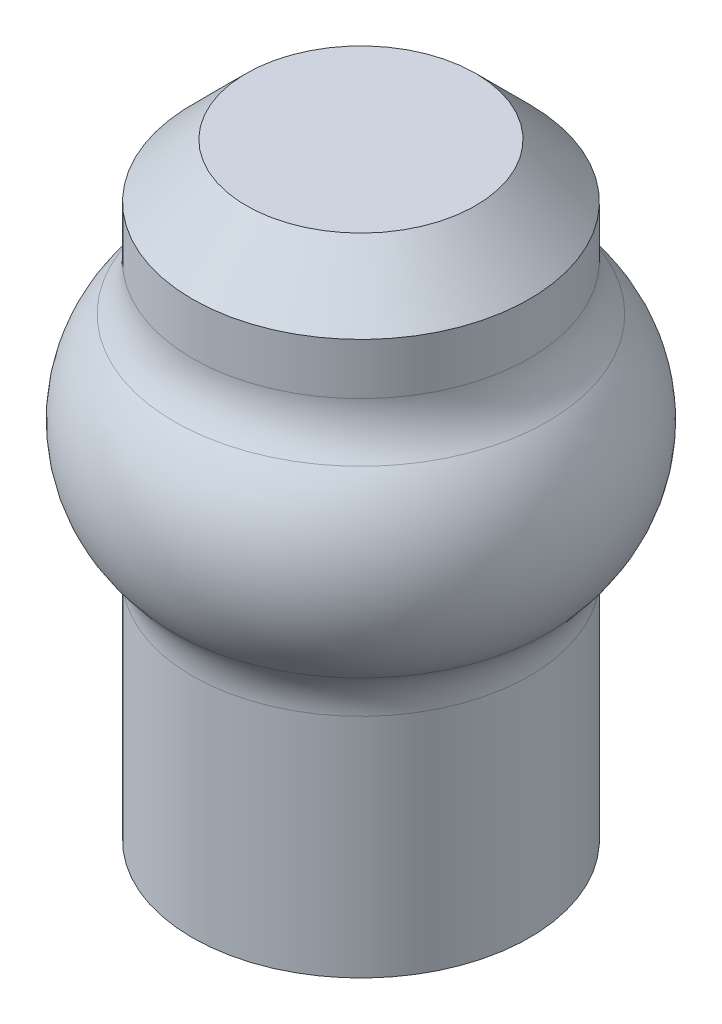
from build123d import *

# Parameters (mm, degrees)
CHAMFER1_SIZE = 4


with BuildPart() as part:
    # Sketch1 → Hub (revolve)
    with BuildSketch(Plane.XY, mode=Mode.PRIVATE) as hub_sk:
        with BuildLine():
            Line((-12.5, 37.198039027), (-12.5, 45))
            Line((-12.5, 45), (0, 45))
            Line((0, 45), (0, 0))
            Line((0, 0), (-12.5, 0))
            Line((-12.5, 0), (-12.5, 16.801960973))
            ThreePointArc((-12.5, 16.801960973), (-12.845253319, 18.627702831), (-13.833333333, 20.201307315))
            ThreePointArc((-13.833333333, 20.201307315), (-16.5, 27), (-13.833333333, 33.798692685))
            ThreePointArc((-13.833333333, 33.798692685), (-12.845253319, 35.372297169), (-12.5, 37.198039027))
        make_face()
    revolve(hub_sk.sketch.rotate(Axis((0, 0, 0), (0, 1, 0)), 270), axis=Axis((0, 0, 0), (0, 1, 0)))

    # Chamfer1
    chamfer1_edges = [part.edges().sort_by_distance(p)[0] for p in [
        (0, 45, 12.5),
    ]]
    chamfer(chamfer1_edges, length=CHAMFER1_SIZE)


solid = part.part
